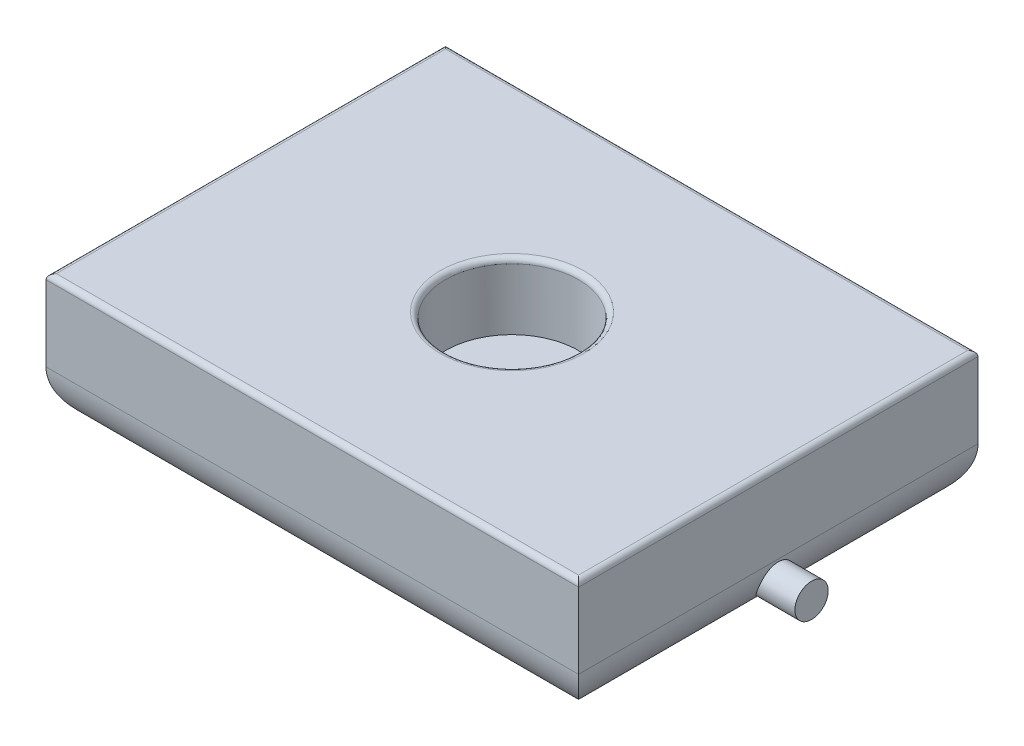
ISO-10303-21;
HEADER;
FILE_DESCRIPTION(('STEP AP214'),'2;1');
FILE_NAME('part.step','',(''),(''),'','','');
FILE_SCHEMA(('AUTOMOTIVE_DESIGN { 1 0 10303 214 1 1 1 1 }'));
ENDSEC;
DATA;
#1=APPLICATION_CONTEXT('core data for automotive mechanical design processes');
#2=APPLICATION_PROTOCOL_DEFINITION('international standard','automotive_design',2000,#1);
#3=PRODUCT_CONTEXT('',#1,'mechanical');
#4=PRODUCT('Part','Part','',(#3));
#5=PRODUCT_RELATED_PRODUCT_CATEGORY('part','',(#4));
#6=PRODUCT_DEFINITION_FORMATION('','',#4);
#7=PRODUCT_DEFINITION_CONTEXT('part definition',#1,'design');
#8=PRODUCT_DEFINITION('design','',#6,#7);
#9=PRODUCT_DEFINITION_SHAPE('','',#8);
#10=(LENGTH_UNIT() NAMED_UNIT(*) SI_UNIT(.MILLI.,.METRE.));
#11=(NAMED_UNIT(*) PLANE_ANGLE_UNIT() SI_UNIT($,.RADIAN.));
#12=(NAMED_UNIT(*) SI_UNIT($,.STERADIAN.) SOLID_ANGLE_UNIT());
#13=UNCERTAINTY_MEASURE_WITH_UNIT(LENGTH_MEASURE(1.E-05),#10,'distance_accuracy_value','');
#14=(GEOMETRIC_REPRESENTATION_CONTEXT(3) GLOBAL_UNCERTAINTY_ASSIGNED_CONTEXT((#13)) GLOBAL_UNIT_ASSIGNED_CONTEXT((#10,
#11,#12)) REPRESENTATION_CONTEXT('',''));
#15=CARTESIAN_POINT('',(0.,0.,0.));
#16=DIRECTION('',(0.,0.,1.));
#17=DIRECTION('',(1.,0.,0.));
#18=AXIS2_PLACEMENT_3D('',#15,#16,#17);
#19=CARTESIAN_POINT('',(-50.8,25.4,38.1));
#20=DIRECTION('',(1.,0.,0.));
#21=DIRECTION('',(0.,0.,-1.));
#22=AXIS2_PLACEMENT_3D('',#19,#20,#21);
#23=PLANE('',#22);
#24=DIRECTION('',(0.,-1.,0.));
#25=VECTOR('',#24,1.);
#26=CARTESIAN_POINT('',(-50.8,25.4,38.1));
#27=LINE('',#26,#25);
#28=CARTESIAN_POINT('',(-50.8,24.4,38.1));
#29=VERTEX_POINT('',#28);
#30=CARTESIAN_POINT('',(-50.8,10.,38.1));
#31=VERTEX_POINT('',#30);
#32=EDGE_CURVE('E115',#29,#31,#27,.T.);
#33=ORIENTED_EDGE('',*,*,#32,.F.);
#34=DIRECTION('',(0.,0.,1.));
#35=VECTOR('',#34,1.);
#36=CARTESIAN_POINT('',(-50.8,24.4,38.1));
#37=LINE('',#36,#35);
#38=CARTESIAN_POINT('',(-50.8,24.4,-38.1));
#39=VERTEX_POINT('',#38);
#40=EDGE_CURVE('E51',#29,#39,#37,.F.);
#41=ORIENTED_EDGE('',*,*,#40,.T.);
#42=DIRECTION('',(0.,-1.,0.));
#43=VECTOR('',#42,1.);
#44=CARTESIAN_POINT('',(-50.8,25.4,-38.1));
#45=LINE('',#44,#43);
#46=CARTESIAN_POINT('',(-50.8,10.,-38.1));
#47=VERTEX_POINT('',#46);
#48=EDGE_CURVE('E247',#39,#47,#45,.T.);
#49=ORIENTED_EDGE('',*,*,#48,.T.);
#50=DIRECTION('',(0.,0.,1.));
#51=VECTOR('',#50,1.);
#52=CARTESIAN_POINT('',(-50.8,10.,38.1));
#53=LINE('',#52,#51);
#54=EDGE_CURVE('E155',#47,#31,#53,.T.);
#55=ORIENTED_EDGE('',*,*,#54,.T.);
#56=EDGE_LOOP('',(#33,#41,#49,#55));
#57=FACE_BOUND('',#56,.T.);
#58=ADVANCED_FACE('F42',(#57),#23,.F.);
#59=CARTESIAN_POINT('',(-50.8,25.4,38.1));
#60=DIRECTION('',(0.,0.,-1.));
#61=DIRECTION('',(-1.,0.,0.));
#62=AXIS2_PLACEMENT_3D('',#59,#60,#61);
#63=PLANE('',#62);
#64=DIRECTION('',(0.,-1.,0.));
#65=VECTOR('',#64,1.);
#66=CARTESIAN_POINT('',(50.8,25.4,38.1));
#67=LINE('',#66,#65);
#68=CARTESIAN_POINT('',(50.8,24.4,38.1));
#69=VERTEX_POINT('',#68);
#70=CARTESIAN_POINT('',(50.8,10.,38.1));
#71=VERTEX_POINT('',#70);
#72=EDGE_CURVE('E108',#69,#71,#67,.T.);
#73=ORIENTED_EDGE('',*,*,#72,.F.);
#74=DIRECTION('',(1.,0.,0.));
#75=VECTOR('',#74,1.);
#76=CARTESIAN_POINT('',(-50.8,24.4,38.1));
#77=LINE('',#76,#75);
#78=EDGE_CURVE('E59',#69,#29,#77,.F.);
#79=ORIENTED_EDGE('',*,*,#78,.T.);
#80=ORIENTED_EDGE('',*,*,#32,.T.);
#81=DIRECTION('',(1.,0.,0.));
#82=VECTOR('',#81,1.);
#83=CARTESIAN_POINT('',(50.8,10.,38.1));
#84=LINE('',#83,#82);
#85=EDGE_CURVE('E124',#31,#71,#84,.T.);
#86=ORIENTED_EDGE('',*,*,#85,.T.);
#87=EDGE_LOOP('',(#73,#79,#80,#86));
#88=FACE_BOUND('',#87,.T.);
#89=ADVANCED_FACE('F138',(#88),#63,.F.);
#90=CARTESIAN_POINT('',(50.8,25.4,38.1));
#91=DIRECTION('',(-1.,0.,0.));
#92=DIRECTION('',(0.,0.,1.));
#93=AXIS2_PLACEMENT_3D('',#90,#91,#92);
#94=PLANE('',#93);
#95=DIRECTION('',(0.,-1.,0.));
#96=VECTOR('',#95,1.);
#97=CARTESIAN_POINT('',(50.8,25.4,-38.1));
#98=LINE('',#97,#96);
#99=CARTESIAN_POINT('',(50.8,24.4,-38.1));
#100=VERTEX_POINT('',#99);
#101=CARTESIAN_POINT('',(50.8,10.,-38.1));
#102=VERTEX_POINT('',#101);
#103=EDGE_CURVE('E116',#100,#102,#98,.T.);
#104=ORIENTED_EDGE('',*,*,#103,.F.);
#105=DIRECTION('',(0.,0.,-1.));
#106=VECTOR('',#105,1.);
#107=CARTESIAN_POINT('',(50.8,24.4,38.1));
#108=LINE('',#107,#106);
#109=EDGE_CURVE('E67',#100,#69,#108,.F.);
#110=ORIENTED_EDGE('',*,*,#109,.T.);
#111=ORIENTED_EDGE('',*,*,#72,.T.);
#112=DIRECTION('',(0.,0.,-1.));
#113=VECTOR('',#112,1.);
#114=CARTESIAN_POINT('',(50.8,10.,-38.1));
#115=LINE('',#114,#113);
#116=EDGE_CURVE('E112',#71,#102,#115,.T.);
#117=ORIENTED_EDGE('',*,*,#116,.T.);
#118=EDGE_LOOP('',(#104,#110,#111,#117));
#119=FACE_BOUND('',#118,.T.);
#120=ADVANCED_FACE('F110',(#119),#94,.F.);
#121=CARTESIAN_POINT('',(-50.8,25.4,-38.1));
#122=DIRECTION('',(0.,0.,1.));
#123=DIRECTION('',(1.,0.,0.));
#124=AXIS2_PLACEMENT_3D('',#121,#122,#123);
#125=PLANE('',#124);
#126=ORIENTED_EDGE('',*,*,#48,.F.);
#127=DIRECTION('',(-1.,0.,0.));
#128=VECTOR('',#127,1.);
#129=CARTESIAN_POINT('',(-50.8,24.4,-38.1));
#130=LINE('',#129,#128);
#131=EDGE_CURVE('E260',#39,#100,#130,.F.);
#132=ORIENTED_EDGE('',*,*,#131,.T.);
#133=ORIENTED_EDGE('',*,*,#103,.T.);
#134=DIRECTION('',(-1.,0.,0.));
#135=VECTOR('',#134,1.);
#136=CARTESIAN_POINT('',(-50.8,10.,-38.1));
#137=LINE('',#136,#135);
#138=EDGE_CURVE('E136',#102,#47,#137,.T.);
#139=ORIENTED_EDGE('',*,*,#138,.T.);
#140=EDGE_LOOP('',(#126,#132,#133,#139));
#141=FACE_BOUND('',#140,.T.);
#142=ADVANCED_FACE('F220',(#141),#125,.F.);
#143=CARTESIAN_POINT('',(0.,25.4,0.));
#144=DIRECTION('',(0.,-1.,0.));
#145=DIRECTION('',(0.,0.,-1.));
#146=AXIS2_PLACEMENT_3D('',#143,#144,#145);
#147=PLANE('',#146);
#148=DIRECTION('',(0.,0.,-1.));
#149=VECTOR('',#148,1.);
#150=CARTESIAN_POINT('',(49.8,25.4,0.));
#151=LINE('',#150,#149);
#152=CARTESIAN_POINT('',(49.8,25.4,37.1));
#153=VERTEX_POINT('',#152);
#154=CARTESIAN_POINT('',(49.8,25.4,-37.1));
#155=VERTEX_POINT('',#154);
#156=EDGE_CURVE('E266',#153,#155,#151,.T.);
#157=ORIENTED_EDGE('',*,*,#156,.T.);
#158=DIRECTION('',(-1.,0.,0.));
#159=VECTOR('',#158,1.);
#160=CARTESIAN_POINT('',(0.,25.4,-37.1));
#161=LINE('',#160,#159);
#162=CARTESIAN_POINT('',(-49.8,25.4,-37.1));
#163=VERTEX_POINT('',#162);
#164=EDGE_CURVE('E262',#155,#163,#161,.T.);
#165=ORIENTED_EDGE('',*,*,#164,.T.);
#166=DIRECTION('',(0.,0.,1.));
#167=VECTOR('',#166,1.);
#168=CARTESIAN_POINT('',(-49.8,25.4,0.));
#169=LINE('',#168,#167);
#170=CARTESIAN_POINT('',(-49.8,25.4,37.1));
#171=VERTEX_POINT('',#170);
#172=EDGE_CURVE('E518',#163,#171,#169,.T.);
#173=ORIENTED_EDGE('',*,*,#172,.T.);
#174=DIRECTION('',(1.,0.,0.));
#175=VECTOR('',#174,1.);
#176=CARTESIAN_POINT('',(0.,25.4,37.1));
#177=LINE('',#176,#175);
#178=EDGE_CURVE('E284',#171,#153,#177,.T.);
#179=ORIENTED_EDGE('',*,*,#178,.T.);
#180=EDGE_LOOP('',(#157,#165,#173,#179));
#181=FACE_BOUND('',#180,.T.);
#182=CARTESIAN_POINT('',(0.,25.4,0.));
#183=DIRECTION('',(0.,-1.,0.));
#184=DIRECTION('',(0.,0.,-1.));
#185=AXIS2_PLACEMENT_3D('',#182,#183,#184);
#186=CIRCLE('',#185,13.7);
#187=CARTESIAN_POINT('',(0.,25.4,-13.7));
#188=VERTEX_POINT('',#187);
#189=EDGE_CURVE('E156',#188,#188,#186,.T.);
#190=ORIENTED_EDGE('',*,*,#189,.T.);
#191=EDGE_LOOP('',(#190));
#192=FACE_BOUND('',#191,.T.);
#193=ADVANCED_FACE('F223',(#181,#192),#147,.F.);
#194=CARTESIAN_POINT('',(0.,0.,0.));
#195=DIRECTION('',(0.,-1.,0.));
#196=DIRECTION('',(0.,0.,-1.));
#197=AXIS2_PLACEMENT_3D('',#194,#195,#196);
#198=PLANE('',#197);
#199=DIRECTION('',(0.,0.,-1.));
#200=VECTOR('',#199,1.);
#201=CARTESIAN_POINT('',(40.8,0.,38.1));
#202=LINE('',#201,#200);
#203=CARTESIAN_POINT('',(40.8,0.,-28.1));
#204=VERTEX_POINT('',#203);
#205=CARTESIAN_POINT('',(40.8,0.,28.1));
#206=VERTEX_POINT('',#205);
#207=EDGE_CURVE('E150',#204,#206,#202,.F.);
#208=ORIENTED_EDGE('',*,*,#207,.T.);
#209=DIRECTION('',(1.,0.,0.));
#210=VECTOR('',#209,1.);
#211=CARTESIAN_POINT('',(-50.8,0.,28.1));
#212=LINE('',#211,#210);
#213=CARTESIAN_POINT('',(-40.8,0.,28.1));
#214=VERTEX_POINT('',#213);
#215=EDGE_CURVE('E126',#206,#214,#212,.F.);
#216=ORIENTED_EDGE('',*,*,#215,.T.);
#217=DIRECTION('',(0.,0.,1.));
#218=VECTOR('',#217,1.);
#219=CARTESIAN_POINT('',(-40.8,0.,-38.1));
#220=LINE('',#219,#218);
#221=CARTESIAN_POINT('',(-40.8,0.,-28.1));
#222=VERTEX_POINT('',#221);
#223=EDGE_CURVE('E140',#214,#222,#220,.F.);
#224=ORIENTED_EDGE('',*,*,#223,.T.);
#225=DIRECTION('',(-1.,0.,0.));
#226=VECTOR('',#225,1.);
#227=CARTESIAN_POINT('',(50.8,0.,-28.1));
#228=LINE('',#227,#226);
#229=EDGE_CURVE('E143',#222,#204,#228,.F.);
#230=ORIENTED_EDGE('',*,*,#229,.T.);
#231=EDGE_LOOP('',(#208,#216,#224,#230));
#232=FACE_BOUND('',#231,.T.);
#233=ADVANCED_FACE('F225',(#232),#198,.T.);
#234=CARTESIAN_POINT('',(0.,12.7,0.));
#235=DIRECTION('',(0.,1.,0.));
#236=DIRECTION('',(0.,0.,1.));
#237=AXIS2_PLACEMENT_3D('',#234,#235,#236);
#238=CYLINDRICAL_SURFACE('',#237,12.7);
#239=CARTESIAN_POINT('',(0.,24.4,0.));
#240=DIRECTION('',(0.,-1.,0.));
#241=DIRECTION('',(0.,0.,-1.));
#242=AXIS2_PLACEMENT_3D('',#239,#240,#241);
#243=CIRCLE('',#242,12.7);
#244=CARTESIAN_POINT('',(0.,24.4,-12.7));
#245=VERTEX_POINT('',#244);
#246=EDGE_CURVE('E11',#245,#245,#243,.F.);
#247=ORIENTED_EDGE('',*,*,#246,.T.);
#248=EDGE_LOOP('',(#247));
#249=FACE_BOUND('',#248,.T.);
#250=CARTESIAN_POINT('',(0.,12.7,0.));
#251=DIRECTION('',(0.,1.,0.));
#252=DIRECTION('',(0.,0.,1.));
#253=AXIS2_PLACEMENT_3D('',#250,#251,#252);
#254=CIRCLE('',#253,12.7);
#255=CARTESIAN_POINT('',(0.,12.7,12.7));
#256=VERTEX_POINT('',#255);
#257=EDGE_CURVE('E245',#256,#256,#254,.T.);
#258=ORIENTED_EDGE('',*,*,#257,.F.);
#259=EDGE_LOOP('',(#258));
#260=FACE_BOUND('',#259,.T.);
#261=ADVANCED_FACE('F228',(#249,#260),#238,.F.);
#262=CARTESIAN_POINT('',(0.,12.7,0.));
#263=DIRECTION('',(0.,1.,0.));
#264=DIRECTION('',(0.,0.,1.));
#265=AXIS2_PLACEMENT_3D('',#262,#263,#264);
#266=PLANE('',#265);
#267=ORIENTED_EDGE('',*,*,#257,.T.);
#268=EDGE_LOOP('',(#267));
#269=FACE_BOUND('',#268,.T.);
#270=ADVANCED_FACE('F234',(#269),#266,.T.);
#271=CARTESIAN_POINT('',(57.15,6.35,0.));
#272=DIRECTION('',(-1.,0.,0.));
#273=DIRECTION('',(0.,0.,1.));
#274=AXIS2_PLACEMENT_3D('',#271,#272,#273);
#275=CYLINDRICAL_SURFACE('',#274,3.175);
#276=CARTESIAN_POINT('',(57.15,6.35,0.));
#277=DIRECTION('',(1.,0.,0.));
#278=DIRECTION('',(0.,0.,-1.));
#279=AXIS2_PLACEMENT_3D('',#276,#277,#278);
#280=CIRCLE('',#279,3.175);
#281=CARTESIAN_POINT('',(57.15,6.35,-3.175));
#282=VERTEX_POINT('',#281);
#283=EDGE_CURVE('E248',#282,#282,#280,.T.);
#284=ORIENTED_EDGE('',*,*,#283,.F.);
#285=EDGE_LOOP('',(#284));
#286=FACE_BOUND('',#285,.T.);
#287=CARTESIAN_POINT('',(50.1936511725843,6.57081385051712,-3.16731214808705));
#288=CARTESIAN_POINT('',(50.2547884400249,6.7383089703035,-3.1556257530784));
#289=CARTESIAN_POINT('',(50.3111683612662,6.90677063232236,-3.1304917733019));
#290=CARTESIAN_POINT('',(50.4133314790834,7.24057988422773,-3.05236165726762));
#291=CARTESIAN_POINT('',(50.4591056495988,7.40592471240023,-2.99934191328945));
#292=CARTESIAN_POINT('',(50.5399370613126,7.72815893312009,-2.86561646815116));
#293=CARTESIAN_POINT('',(50.5749785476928,7.88503561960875,-2.78487043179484));
#294=CARTESIAN_POINT('',(50.6350055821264,8.18450353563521,-2.59738800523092));
#295=CARTESIAN_POINT('',(50.6599929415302,8.32709733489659,-2.49065630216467));
#296=CARTESIAN_POINT('',(50.7008684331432,8.58933830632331,-2.25741640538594));
#297=CARTESIAN_POINT('',(50.7169909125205,8.70951455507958,-2.13154282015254));
#298=CARTESIAN_POINT('',(50.742977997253,8.92793704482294,-1.86146002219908));
#299=CARTESIAN_POINT('',(50.7528422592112,9.02618208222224,-1.71724980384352));
#300=CARTESIAN_POINT('',(50.7681985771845,9.19839324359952,-1.41349593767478));
#301=CARTESIAN_POINT('',(50.7736605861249,9.27219052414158,-1.25385510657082));
#302=CARTESIAN_POINT('',(50.7817112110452,9.39246814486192,-0.924526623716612));
#303=CARTESIAN_POINT('',(50.7842996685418,9.43894697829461,-0.75483841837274));
#304=CARTESIAN_POINT('',(50.7877310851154,9.50370340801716,-0.407840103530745));
#305=CARTESIAN_POINT('',(50.7885507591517,9.521604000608,-0.230459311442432));
#306=CARTESIAN_POINT('',(50.7888321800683,9.52751696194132,0.124804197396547));
#307=CARTESIAN_POINT('',(50.78829387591,9.51552820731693,0.302686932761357));
#308=CARTESIAN_POINT('',(50.7855478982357,9.461904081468,0.654571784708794));
#309=CARTESIAN_POINT('',(50.7833342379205,9.42016242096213,0.828557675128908));
#310=CARTESIAN_POINT('',(50.7761929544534,9.30811658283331,1.16702551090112));
#311=CARTESIAN_POINT('',(50.7712652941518,9.23781201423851,1.33150732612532));
#312=CARTESIAN_POINT('',(50.7570960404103,9.07091192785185,1.64585995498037));
#313=CARTESIAN_POINT('',(50.747864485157,8.97437780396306,1.79576379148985));
#314=CARTESIAN_POINT('',(50.723158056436,8.75792221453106,2.07702028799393));
#315=CARTESIAN_POINT('',(50.7076839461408,8.63800360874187,2.2083752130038));
#316=CARTESIAN_POINT('',(50.6687939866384,8.38023114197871,2.44730444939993));
#317=CARTESIAN_POINT('',(50.6454751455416,8.2426084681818,2.55514391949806));
#318=CARTESIAN_POINT('',(50.5893474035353,7.95295418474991,2.74613344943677));
#319=CARTESIAN_POINT('',(50.5565399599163,7.800924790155,2.82928729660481));
#320=CARTESIAN_POINT('',(50.480981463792,7.48921703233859,2.9684422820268));
#321=CARTESIAN_POINT('',(50.4383360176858,7.32963328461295,3.02471356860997));
#322=CARTESIAN_POINT('',(50.3429099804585,7.00646329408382,3.11089463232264));
#323=CARTESIAN_POINT('',(50.2901280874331,6.84287653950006,3.14080102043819));
#324=CARTESIAN_POINT('',(50.1733815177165,6.5112198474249,3.17542295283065));
#325=CARTESIAN_POINT('',(50.1091166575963,6.34317123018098,3.17931428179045));
#326=CARTESIAN_POINT('',(49.9721415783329,6.01202046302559,3.1613171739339));
#327=CARTESIAN_POINT('',(49.8994288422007,5.84891980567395,3.13942103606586));
#328=CARTESIAN_POINT('',(49.7403317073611,5.5158434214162,3.06862863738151));
#329=CARTESIAN_POINT('',(49.6533046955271,5.34667907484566,3.01737207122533));
#330=CARTESIAN_POINT('',(49.4744415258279,5.02118136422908,2.88886405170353));
#331=CARTESIAN_POINT('',(49.3826013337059,4.8648590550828,2.81159048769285));
#332=CARTESIAN_POINT('',(49.1863658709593,4.54955703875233,2.62236554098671));
#333=CARTESIAN_POINT('',(49.0817883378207,4.39251626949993,2.5073624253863));
#334=CARTESIAN_POINT('',(48.8764197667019,4.10057156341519,2.24914785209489));
#335=CARTESIAN_POINT('',(48.7756281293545,3.96566411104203,2.10594088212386));
#336=CARTESIAN_POINT('',(48.6043654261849,3.7464253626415,1.82405235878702));
#337=CARTESIAN_POINT('',(48.5318755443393,3.65737993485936,1.69026524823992));
#338=CARTESIAN_POINT('',(48.3989740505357,3.49874795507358,1.40618147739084));
#339=CARTESIAN_POINT('',(48.3385418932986,3.42912822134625,1.25591358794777));
#340=CARTESIAN_POINT('',(48.2458917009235,3.3244772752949,0.97208985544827));
#341=CARTESIAN_POINT('',(48.2104562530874,3.28532658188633,0.841118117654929));
#342=CARTESIAN_POINT('',(48.1543834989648,3.2239541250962,0.572209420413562));
#343=CARTESIAN_POINT('',(48.1337319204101,3.20171603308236,0.43427931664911));
#344=CARTESIAN_POINT('',(48.1094751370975,3.17563784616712,0.154487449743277));
#345=CARTESIAN_POINT('',(48.1059507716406,3.17188499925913,0.0126102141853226));
#346=CARTESIAN_POINT('',(48.1166212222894,3.18332155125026,-0.269701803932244));
#347=CARTESIAN_POINT('',(48.1308187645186,3.19851386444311,-0.41013636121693));
#348=CARTESIAN_POINT('',(48.1736877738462,3.24503016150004,-0.67583928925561));
#349=CARTESIAN_POINT('',(48.2013119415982,3.27518980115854,-0.801490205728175));
#350=CARTESIAN_POINT('',(48.268008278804,3.34933577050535,-1.04542898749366));
#351=CARTESIAN_POINT('',(48.3070882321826,3.39333150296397,-1.16371177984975));
#352=CARTESIAN_POINT('',(48.4130662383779,3.51538393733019,-1.44137599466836));
#353=CARTESIAN_POINT('',(48.4846569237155,3.5999228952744,-1.59612114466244));
#354=CARTESIAN_POINT('',(48.6389963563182,3.78991497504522,-1.88592975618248));
#355=CARTESIAN_POINT('',(48.721762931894,3.89540164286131,-2.02096103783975));
#356=CARTESIAN_POINT('',(48.8945456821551,4.12637376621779,-2.27283946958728));
#357=CARTESIAN_POINT('',(48.9846657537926,4.25218585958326,-2.38931436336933));
#358=CARTESIAN_POINT('',(49.1664222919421,4.52010357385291,-2.60023368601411));
#359=CARTESIAN_POINT('',(49.2580593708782,4.66221591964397,-2.69466897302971));
#360=CARTESIAN_POINT('',(49.4553561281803,4.98733005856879,-2.87472167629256));
#361=CARTESIAN_POINT('',(49.5606351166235,5.17312122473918,-2.95583861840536));
#362=CARTESIAN_POINT('',(49.7123970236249,5.46335025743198,-3.05038261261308));
#363=CARTESIAN_POINT('',(49.7619387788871,5.56197328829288,-3.07736974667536));
#364=CARTESIAN_POINT('',(49.8584843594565,5.76252384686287,-3.12186342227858));
#365=CARTESIAN_POINT('',(49.9054895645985,5.86444952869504,-3.13937516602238));
#366=CARTESIAN_POINT('',(49.9944700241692,6.06638057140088,-3.16386989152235));
#367=CARTESIAN_POINT('',(50.0365750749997,6.16627704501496,-3.17127715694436));
#368=CARTESIAN_POINT('',(50.1175895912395,6.36760123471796,-3.1765495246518));
#369=CARTESIAN_POINT('',(50.1564987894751,6.46902907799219,-3.17441382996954));
#370=CARTESIAN_POINT('',(50.1936511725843,6.57081385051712,-3.16731214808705));
#371=B_SPLINE_CURVE_WITH_KNOTS('',3,(#287,#288,#289,#290,#291,#292,#293,#294,#295,#296,#297,
#298,#299,#300,#301,#302,#303,#304,#305,#306,#307,#308,#309,#310,#311,#312,#313,#314,#315,#316,
#317,#318,#319,#320,#321,#322,#323,#324,#325,#326,#327,#328,#329,#330,#331,#332,#333,#334,#335,
#336,#337,#338,#339,#340,#341,#342,#343,#344,#345,#346,#347,#348,#349,#350,#351,#352,#353,#354,
#355,#356,#357,#358,#359,#360,#361,#362,#363,#364,#365,#366,#367,#368,#369,#370),.UNSPECIFIED.,
.T.,.F.,(4,2,2,2,2,2,2,2,2,2,2,2,2,2,2,2,2,2,2,2,2,2,2,2,2,2,2,2,2,2,2,2,2,2,2,2,2,2,2,2,2,4),
(0.,0.535698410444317,1.07185106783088,1.60878702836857,2.14562621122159,2.66749251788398,
3.18938745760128,3.71481506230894,4.24027164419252,4.77260440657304,5.30495717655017,
5.83922131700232,6.37349277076,6.90652430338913,7.43949069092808,7.96609488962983,
8.49261825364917,9.01373297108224,9.53491466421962,10.0725333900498,10.6103127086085,
11.1990140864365,11.7882170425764,12.4482389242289,13.1081558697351,13.6352014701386,
14.1613412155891,14.5832808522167,15.0048125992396,15.4283320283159,15.8519166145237,
16.2467639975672,16.6418802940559,17.2097133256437,17.7784631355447,18.3574798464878,
18.9367363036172,19.618262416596,19.9587405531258,20.2990315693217,20.6245418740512,
20.9500793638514),.UNSPECIFIED.);
#372=CARTESIAN_POINT('',(50.1936511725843,6.57081385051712,-3.16731214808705));
#373=VERTEX_POINT('',#372);
#374=EDGE_CURVE('E141',#373,#373,#371,.T.);
#375=ORIENTED_EDGE('',*,*,#374,.T.);
#376=EDGE_LOOP('',(#375));
#377=FACE_BOUND('',#376,.T.);
#378=ADVANCED_FACE('F175',(#286,#377),#275,.T.);
#379=CARTESIAN_POINT('',(57.15,0.,0.));
#380=DIRECTION('',(1.,0.,0.));
#381=DIRECTION('',(0.,0.,-1.));
#382=AXIS2_PLACEMENT_3D('',#379,#380,#381);
#383=PLANE('',#382);
#384=ORIENTED_EDGE('',*,*,#283,.T.);
#385=EDGE_LOOP('',(#384));
#386=FACE_BOUND('',#385,.T.);
#387=ADVANCED_FACE('F241',(#386),#383,.T.);
#388=CARTESIAN_POINT('',(-57.15,6.35,0.));
#389=DIRECTION('',(1.,0.,0.));
#390=DIRECTION('',(0.,0.,-1.));
#391=AXIS2_PLACEMENT_3D('',#388,#389,#390);
#392=CYLINDRICAL_SURFACE('',#391,3.175);
#393=CARTESIAN_POINT('',(-57.15,6.35,0.));
#394=DIRECTION('',(1.,0.,0.));
#395=DIRECTION('',(0.,0.,-1.));
#396=AXIS2_PLACEMENT_3D('',#393,#394,#395);
#397=CIRCLE('',#396,3.175);
#398=CARTESIAN_POINT('',(-57.15,6.35,-3.175));
#399=VERTEX_POINT('',#398);
#400=EDGE_CURVE('E252',#399,#399,#397,.T.);
#401=ORIENTED_EDGE('',*,*,#400,.T.);
#402=EDGE_LOOP('',(#401));
#403=FACE_BOUND('',#402,.T.);
#404=CARTESIAN_POINT('',(-50.1936511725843,6.57081385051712,3.16731214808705));
#405=CARTESIAN_POINT('',(-50.1585510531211,6.47466489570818,3.17401475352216));
#406=CARTESIAN_POINT('',(-50.1218566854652,6.37874684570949,3.17629596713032));
#407=CARTESIAN_POINT('',(-50.0455880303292,6.18821899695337,3.17231033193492));
#408=CARTESIAN_POINT('',(-50.006011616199,6.0936102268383,3.16603710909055));
#409=CARTESIAN_POINT('',(-49.8832495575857,5.81236399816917,3.13482876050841));
#410=CARTESIAN_POINT('',(-49.7961609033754,5.62866137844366,3.09748279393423));
#411=CARTESIAN_POINT('',(-49.6155323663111,5.27498866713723,2.99313515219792));
#412=CARTESIAN_POINT('',(-49.5220334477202,5.1049441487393,2.92630922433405));
#413=CARTESIAN_POINT('',(-49.3316439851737,4.78018486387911,2.76570283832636));
#414=CARTESIAN_POINT('',(-49.2347529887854,4.62547215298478,2.6719187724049));
#415=CARTESIAN_POINT('',(-49.032057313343,4.31931492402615,2.44874590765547));
#416=CARTESIAN_POINT('',(-48.9263228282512,4.16972025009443,2.3167464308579));
#417=CARTESIAN_POINT('',(-48.7224006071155,3.89552058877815,2.02393411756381));
#418=CARTESIAN_POINT('',(-48.6242063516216,3.77089386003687,1.86314658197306));
#419=CARTESIAN_POINT('',(-48.4699128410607,3.58261232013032,1.56335164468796));
#420=CARTESIAN_POINT('',(-48.4097540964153,3.51167599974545,1.43100166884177));
#421=CARTESIAN_POINT('',(-48.3024966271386,3.38794698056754,1.15320550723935));
#422=CARTESIAN_POINT('',(-48.2553746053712,3.33512187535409,1.00778330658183));
#423=CARTESIAN_POINT('',(-48.1849692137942,3.2572584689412,0.730056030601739));
#424=CARTESIAN_POINT('',(-48.159105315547,3.22916050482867,0.599273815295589));
#425=CARTESIAN_POINT('',(-48.122576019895,3.18966748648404,0.333130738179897));
#426=CARTESIAN_POINT('',(-48.1119001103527,3.1782608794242,0.197773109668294));
#427=CARTESIAN_POINT('',(-48.1069408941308,3.17294841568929,-0.0738511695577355));
#428=CARTESIAN_POINT('',(-48.1126885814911,3.1790756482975,-0.210119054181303));
#429=CARTESIAN_POINT('',(-48.1399717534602,3.20844680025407,-0.4791756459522));
#430=CARTESIAN_POINT('',(-48.1615144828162,3.23169857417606,-0.611962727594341));
#431=CARTESIAN_POINT('',(-48.217691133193,3.29332154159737,-0.868620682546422));
#432=CARTESIAN_POINT('',(-48.2521089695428,3.33144359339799,-0.992600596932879));
#433=CARTESIAN_POINT('',(-48.3313089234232,3.42102123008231,-1.23210733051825));
#434=CARTESIAN_POINT('',(-48.3760982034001,3.47248603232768,-1.34762823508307));
#435=CARTESIAN_POINT('',(-48.4973441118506,3.61537696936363,-1.62393841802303));
#436=CARTESIAN_POINT('',(-48.5785241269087,3.71399330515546,-1.77895334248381));
#437=CARTESIAN_POINT('',(-48.7505065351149,3.93296680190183,-2.06673100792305));
#438=CARTESIAN_POINT('',(-48.8413252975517,4.05336120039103,-2.1994548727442));
#439=CARTESIAN_POINT('',(-49.0283758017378,4.31492210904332,-2.44368393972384));
#440=CARTESIAN_POINT('',(-49.1246706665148,4.45638856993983,-2.55481804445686));
#441=CARTESIAN_POINT('',(-49.3167584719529,4.75629180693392,-2.75188543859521));
#442=CARTESIAN_POINT('',(-49.4125514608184,4.91472692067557,-2.83782119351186));
#443=CARTESIAN_POINT('',(-49.5586934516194,5.17332651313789,-2.95065717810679));
#444=CARTESIAN_POINT('',(-49.6105786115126,5.26863754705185,-2.9869325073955));
#445=CARTESIAN_POINT('',(-49.7123509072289,5.46325750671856,-3.05037342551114));
#446=CARTESIAN_POINT('',(-49.7622388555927,5.56256477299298,-3.07754275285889));
#447=CARTESIAN_POINT('',(-49.8594612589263,5.76458535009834,-3.12227847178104));
#448=CARTESIAN_POINT('',(-49.9067948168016,5.86729983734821,-3.13984150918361));
#449=CARTESIAN_POINT('',(-49.9983344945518,6.07526627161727,-3.16482294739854));
#450=CARTESIAN_POINT('',(-50.0425425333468,6.1805166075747,-3.17224762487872));
#451=CARTESIAN_POINT('',(-50.1240864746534,6.38440669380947,-3.17632089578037));
#452=CARTESIAN_POINT('',(-50.1616894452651,6.48292381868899,-3.17376279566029));
#453=CARTESIAN_POINT('',(-50.2335362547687,6.68044756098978,-3.15930810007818));
#454=CARTESIAN_POINT('',(-50.2677819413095,6.7794538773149,-3.14741667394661));
#455=CARTESIAN_POINT('',(-50.3326877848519,6.97697741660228,-3.11408896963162));
#456=CARTESIAN_POINT('',(-50.3633499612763,7.07549488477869,-3.0926581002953));
#457=CARTESIAN_POINT('',(-50.4209727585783,7.27103168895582,-3.04015937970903));
#458=CARTESIAN_POINT('',(-50.4479338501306,7.36805121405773,-3.00909275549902));
#459=CARTESIAN_POINT('',(-50.4950430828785,7.54771934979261,-2.94179100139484));
#460=CARTESIAN_POINT('',(-50.5156212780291,7.63067003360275,-2.90665855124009));
#461=CARTESIAN_POINT('',(-50.5539659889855,7.79383309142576,-2.8291572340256));
#462=CARTESIAN_POINT('',(-50.5717315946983,7.87404457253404,-2.78678603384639));
#463=CARTESIAN_POINT('',(-50.6045435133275,8.03090317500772,-2.69507587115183));
#464=CARTESIAN_POINT('',(-50.6195914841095,8.10755244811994,-2.64574118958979));
#465=CARTESIAN_POINT('',(-50.647153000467,8.25663108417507,-2.54041914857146));
#466=CARTESIAN_POINT('',(-50.6596656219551,8.32905890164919,-2.48442937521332));
#467=CARTESIAN_POINT('',(-50.6924455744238,8.53119155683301,-2.31362881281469));
#468=CARTESIAN_POINT('',(-50.709740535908,8.65468631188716,-2.19071234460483));
#469=CARTESIAN_POINT('',(-50.7377491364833,8.88012531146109,-1.92597279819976));
#470=CARTESIAN_POINT('',(-50.7484628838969,8.98206991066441,-1.78415003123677));
#471=CARTESIAN_POINT('',(-50.7652228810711,9.16182676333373,-1.4848696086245));
#472=CARTESIAN_POINT('',(-50.7712491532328,9.2395348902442,-1.32734822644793));
#473=CARTESIAN_POINT('',(-50.7802155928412,9.36796573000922,-1.00158638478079));
#474=CARTESIAN_POINT('',(-50.7831555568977,9.41868666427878,-0.833345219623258));
#475=CARTESIAN_POINT('',(-50.7871694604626,9.49222223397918,-0.488440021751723));
#476=CARTESIAN_POINT('',(-50.7882174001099,9.51464678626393,-0.311692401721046));
#477=CARTESIAN_POINT('',(-50.7889362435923,9.52966898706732,0.043071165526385));
#478=CARTESIAN_POINT('',(-50.7886070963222,9.52226552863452,0.221087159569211));
#479=CARTESIAN_POINT('',(-50.7863778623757,9.47774654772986,0.574116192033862));
#480=CARTESIAN_POINT('',(-50.7844712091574,9.44050684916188,0.749113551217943));
#481=CARTESIAN_POINT('',(-50.7781455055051,9.3372272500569,1.09035599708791));
#482=CARTESIAN_POINT('',(-50.7737263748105,9.27118642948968,1.25660080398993));
#483=CARTESIAN_POINT('',(-50.7608458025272,9.11238781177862,1.57526853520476));
#484=CARTESIAN_POINT('',(-50.752391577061,9.01967782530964,1.72771555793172));
#485=CARTESIAN_POINT('',(-50.7295393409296,8.81033990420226,2.0146657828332));
#486=CARTESIAN_POINT('',(-50.7151425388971,8.69371683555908,2.14917262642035));
#487=CARTESIAN_POINT('',(-50.6786565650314,8.44175527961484,2.39495447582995));
#488=CARTESIAN_POINT('',(-50.6566565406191,8.30664419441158,2.50647579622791));
#489=CARTESIAN_POINT('',(-50.6033265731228,8.02115429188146,2.70520129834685));
#490=CARTESIAN_POINT('',(-50.571993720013,7.87077072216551,2.79239787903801));
#491=CARTESIAN_POINT('',(-50.4994490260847,7.56163469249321,2.93965790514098));
#492=CARTESIAN_POINT('',(-50.4583481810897,7.40299087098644,3.00000576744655));
#493=CARTESIAN_POINT('',(-50.3659898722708,7.08113868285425,3.09420312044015));
#494=CARTESIAN_POINT('',(-50.3147522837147,6.91793977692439,3.12810383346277));
#495=CARTESIAN_POINT('',(-50.2483098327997,6.72425419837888,3.15301829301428));
#496=CARTESIAN_POINT('',(-50.2376062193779,6.69354385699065,3.15651004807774));
#497=CARTESIAN_POINT('',(-50.2158727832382,6.63215247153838,3.16258831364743));
#498=CARTESIAN_POINT('',(-50.2048430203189,6.60147142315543,3.16517498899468));
#499=CARTESIAN_POINT('',(-50.1936511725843,6.57081385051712,3.16731214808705));
#500=B_SPLINE_CURVE_WITH_KNOTS('',3,(#404,#405,#406,#407,#408,#409,#410,#411,#412,#413,#414,
#415,#416,#417,#418,#419,#420,#421,#422,#423,#424,#425,#426,#427,#428,#429,#430,#431,#432,#433,
#434,#435,#436,#437,#438,#439,#440,#441,#442,#443,#444,#445,#446,#447,#448,#449,#450,#451,#452,
#453,#454,#455,#456,#457,#458,#459,#460,#461,#462,#463,#464,#465,#466,#467,#468,#469,#470,#471,
#472,#473,#474,#475,#476,#477,#478,#479,#480,#481,#482,#483,#484,#485,#486,#487,#488,#489,#490,
#491,#492,#493,#494,#495,#496,#497,#498,#499),.UNSPECIFIED.,.T.,.F.,(4,2,2,2,2,2,2,2,2,2,2,2,2,
2,2,2,2,2,2,2,2,2,2,2,2,2,2,2,2,2,2,2,2,2,2,2,2,2,2,2,2,2,2,2,2,2,2,4),(0.,0.307682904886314,
0.615595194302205,1.23253974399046,1.84585500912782,2.45925239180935,3.13355597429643,
3.8072698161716,4.29086973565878,4.77359977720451,5.1805747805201,5.58726796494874,
5.9947291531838,6.40237734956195,6.80347032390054,7.20484112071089,7.8041720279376,
8.40453756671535,9.01445285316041,9.62430844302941,9.96719006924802,10.3099307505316,
10.6527910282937,10.9954389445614,11.3114335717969,11.6272533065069,11.942894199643,
12.2584949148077,12.5353520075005,12.8122985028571,13.0890754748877,13.3659531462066,
13.8885411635,14.4111205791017,14.9359151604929,15.460744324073,15.9927322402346,
16.5247398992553,17.0589733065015,17.5932237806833,18.1265223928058,18.6597125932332,
19.1868521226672,19.7141561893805,20.2357330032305,20.7562971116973,20.8544212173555,
20.9525274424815),.UNSPECIFIED.);
#501=CARTESIAN_POINT('',(-50.1936511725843,6.57081385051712,3.16731214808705));
#502=VERTEX_POINT('',#501);
#503=EDGE_CURVE('E162',#502,#502,#500,.T.);
#504=ORIENTED_EDGE('',*,*,#503,.F.);
#505=EDGE_LOOP('',(#504));
#506=FACE_BOUND('',#505,.T.);
#507=ADVANCED_FACE('F296',(#403,#506),#392,.T.);
#508=CARTESIAN_POINT('',(-57.15,0.,0.));
#509=DIRECTION('',(-1.,0.,0.));
#510=DIRECTION('',(0.,0.,-1.));
#511=AXIS2_PLACEMENT_3D('',#508,#509,#510);
#512=PLANE('',#511);
#513=ORIENTED_EDGE('',*,*,#400,.F.);
#514=EDGE_LOOP('',(#513));
#515=FACE_BOUND('',#514,.T.);
#516=ADVANCED_FACE('F191',(#515),#512,.T.);
#517=CARTESIAN_POINT('',(-50.8,10.,-28.1));
#518=DIRECTION('',(1.,0.,0.));
#519=DIRECTION('',(0.,0.,-1.));
#520=AXIS2_PLACEMENT_3D('',#517,#518,#519);
#521=CYLINDRICAL_SURFACE('',#520,10.);
#522=CARTESIAN_POINT('',(40.8,10.,-28.1));
#523=DIRECTION('',(0.707106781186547,0.,0.707106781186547));
#524=DIRECTION('',(0.707106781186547,0.,-0.707106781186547));
#525=AXIS2_PLACEMENT_3D('',#522,#523,#524);
#526=ELLIPSE('',#525,14.1421356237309,10.);
#527=EDGE_CURVE('E135',#204,#102,#526,.T.);
#528=ORIENTED_EDGE('',*,*,#527,.F.);
#529=ORIENTED_EDGE('',*,*,#229,.F.);
#530=CARTESIAN_POINT('',(-40.8,10.,-28.1));
#531=DIRECTION('',(0.707106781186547,0.,-0.707106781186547));
#532=DIRECTION('',(-0.707106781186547,0.,-0.707106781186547));
#533=AXIS2_PLACEMENT_3D('',#530,#531,#532);
#534=ELLIPSE('',#533,14.1421356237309,10.);
#535=EDGE_CURVE('E160',#47,#222,#534,.F.);
#536=ORIENTED_EDGE('',*,*,#535,.F.);
#537=ORIENTED_EDGE('',*,*,#138,.F.);
#538=EDGE_LOOP('',(#528,#529,#536,#537));
#539=FACE_BOUND('',#538,.T.);
#540=ADVANCED_FACE('F187',(#539),#521,.T.);
#541=CARTESIAN_POINT('',(-40.8,10.,38.1));
#542=DIRECTION('',(0.,0.,-1.));
#543=DIRECTION('',(-1.,0.,0.));
#544=AXIS2_PLACEMENT_3D('',#541,#542,#543);
#545=CYLINDRICAL_SURFACE('',#544,10.);
#546=ORIENTED_EDGE('',*,*,#535,.T.);
#547=ORIENTED_EDGE('',*,*,#223,.F.);
#548=CARTESIAN_POINT('',(-40.8,10.,28.1));
#549=DIRECTION('',(-0.707106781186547,0.,-0.707106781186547));
#550=DIRECTION('',(0.707106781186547,0.,-0.707106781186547));
#551=AXIS2_PLACEMENT_3D('',#548,#549,#550);
#552=ELLIPSE('',#551,14.1421356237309,10.);
#553=EDGE_CURVE('E129',#31,#214,#552,.F.);
#554=ORIENTED_EDGE('',*,*,#553,.F.);
#555=ORIENTED_EDGE('',*,*,#54,.F.);
#556=EDGE_LOOP('',(#546,#547,#554,#555));
#557=FACE_BOUND('',#556,.T.);
#558=ORIENTED_EDGE('',*,*,#503,.T.);
#559=EDGE_LOOP('',(#558));
#560=FACE_BOUND('',#559,.T.);
#561=ADVANCED_FACE('F182',(#557,#560),#545,.T.);
#562=CARTESIAN_POINT('',(40.8,10.,38.1));
#563=DIRECTION('',(0.,0.,1.));
#564=DIRECTION('',(1.,0.,0.));
#565=AXIS2_PLACEMENT_3D('',#562,#563,#564);
#566=CYLINDRICAL_SURFACE('',#565,10.);
#567=ORIENTED_EDGE('',*,*,#527,.T.);
#568=ORIENTED_EDGE('',*,*,#116,.F.);
#569=CARTESIAN_POINT('',(40.8,10.,28.1));
#570=DIRECTION('',(-0.707106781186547,0.,0.707106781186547));
#571=DIRECTION('',(0.707106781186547,0.,0.707106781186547));
#572=AXIS2_PLACEMENT_3D('',#569,#570,#571);
#573=ELLIPSE('',#572,14.1421356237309,10.);
#574=EDGE_CURVE('E122',#206,#71,#573,.T.);
#575=ORIENTED_EDGE('',*,*,#574,.F.);
#576=ORIENTED_EDGE('',*,*,#207,.F.);
#577=EDGE_LOOP('',(#567,#568,#575,#576));
#578=FACE_BOUND('',#577,.T.);
#579=ORIENTED_EDGE('',*,*,#374,.F.);
#580=EDGE_LOOP('',(#579));
#581=FACE_BOUND('',#580,.T.);
#582=ADVANCED_FACE('F132',(#578,#581),#566,.T.);
#583=CARTESIAN_POINT('',(-50.8,10.,28.1));
#584=DIRECTION('',(-1.,0.,0.));
#585=DIRECTION('',(0.,0.,1.));
#586=AXIS2_PLACEMENT_3D('',#583,#584,#585);
#587=CYLINDRICAL_SURFACE('',#586,10.);
#588=ORIENTED_EDGE('',*,*,#553,.T.);
#589=ORIENTED_EDGE('',*,*,#215,.F.);
#590=ORIENTED_EDGE('',*,*,#574,.T.);
#591=ORIENTED_EDGE('',*,*,#85,.F.);
#592=EDGE_LOOP('',(#588,#589,#590,#591));
#593=FACE_BOUND('',#592,.T.);
#594=ADVANCED_FACE('F123',(#593),#587,.T.);
#595=CARTESIAN_POINT('',(0.,24.4,37.1));
#596=DIRECTION('',(1.,0.,0.));
#597=DIRECTION('',(0.,0.,-1.));
#598=AXIS2_PLACEMENT_3D('',#595,#596,#597);
#599=CYLINDRICAL_SURFACE('',#598,1.);
#600=CARTESIAN_POINT('',(-49.8,24.4,37.1));
#601=DIRECTION('',(0.707106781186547,0.,0.707106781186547));
#602=DIRECTION('',(-0.707106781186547,0.,0.707106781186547));
#603=AXIS2_PLACEMENT_3D('',#600,#601,#602);
#604=ELLIPSE('',#603,1.41421356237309,1.);
#605=EDGE_CURVE('E275',#29,#171,#604,.F.);
#606=ORIENTED_EDGE('',*,*,#605,.F.);
#607=ORIENTED_EDGE('',*,*,#78,.F.);
#608=CARTESIAN_POINT('',(49.8,24.4,37.1));
#609=DIRECTION('',(0.707106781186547,0.,-0.707106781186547));
#610=DIRECTION('',(0.707106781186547,0.,0.707106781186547));
#611=AXIS2_PLACEMENT_3D('',#608,#609,#610);
#612=ELLIPSE('',#611,1.41421356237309,1.);
#613=EDGE_CURVE('E46',#153,#69,#612,.T.);
#614=ORIENTED_EDGE('',*,*,#613,.F.);
#615=ORIENTED_EDGE('',*,*,#178,.F.);
#616=EDGE_LOOP('',(#606,#607,#614,#615));
#617=FACE_BOUND('',#616,.T.);
#618=ADVANCED_FACE('F203',(#617),#599,.T.);
#619=CARTESIAN_POINT('',(49.8,24.4,0.));
#620=DIRECTION('',(0.,0.,-1.));
#621=DIRECTION('',(-1.,0.,0.));
#622=AXIS2_PLACEMENT_3D('',#619,#620,#621);
#623=CYLINDRICAL_SURFACE('',#622,1.);
#624=ORIENTED_EDGE('',*,*,#613,.T.);
#625=ORIENTED_EDGE('',*,*,#109,.F.);
#626=CARTESIAN_POINT('',(49.8,24.4,-37.1));
#627=DIRECTION('',(-0.707106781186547,0.,-0.707106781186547));
#628=DIRECTION('',(0.707106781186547,0.,-0.707106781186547));
#629=AXIS2_PLACEMENT_3D('',#626,#627,#628);
#630=ELLIPSE('',#629,1.41421356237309,1.);
#631=EDGE_CURVE('E274',#155,#100,#630,.T.);
#632=ORIENTED_EDGE('',*,*,#631,.F.);
#633=ORIENTED_EDGE('',*,*,#156,.F.);
#634=EDGE_LOOP('',(#624,#625,#632,#633));
#635=FACE_BOUND('',#634,.T.);
#636=ADVANCED_FACE('F200',(#635),#623,.T.);
#637=CARTESIAN_POINT('',(-49.8,24.4,0.));
#638=DIRECTION('',(0.,0.,1.));
#639=DIRECTION('',(1.,0.,0.));
#640=AXIS2_PLACEMENT_3D('',#637,#638,#639);
#641=CYLINDRICAL_SURFACE('',#640,1.);
#642=ORIENTED_EDGE('',*,*,#605,.T.);
#643=ORIENTED_EDGE('',*,*,#172,.F.);
#644=CARTESIAN_POINT('',(-49.8,24.4,-37.1));
#645=DIRECTION('',(-0.707106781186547,0.,0.707106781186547));
#646=DIRECTION('',(0.707106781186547,0.,0.707106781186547));
#647=AXIS2_PLACEMENT_3D('',#644,#645,#646);
#648=ELLIPSE('',#647,1.41421356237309,1.);
#649=EDGE_CURVE('E272',#39,#163,#648,.F.);
#650=ORIENTED_EDGE('',*,*,#649,.F.);
#651=ORIENTED_EDGE('',*,*,#40,.F.);
#652=EDGE_LOOP('',(#642,#643,#650,#651));
#653=FACE_BOUND('',#652,.T.);
#654=ADVANCED_FACE('F196',(#653),#641,.T.);
#655=CARTESIAN_POINT('',(0.,24.4,-37.1));
#656=DIRECTION('',(-1.,0.,0.));
#657=DIRECTION('',(0.,0.,1.));
#658=AXIS2_PLACEMENT_3D('',#655,#656,#657);
#659=CYLINDRICAL_SURFACE('',#658,1.);
#660=ORIENTED_EDGE('',*,*,#631,.T.);
#661=ORIENTED_EDGE('',*,*,#131,.F.);
#662=ORIENTED_EDGE('',*,*,#649,.T.);
#663=ORIENTED_EDGE('',*,*,#164,.F.);
#664=EDGE_LOOP('',(#660,#661,#662,#663));
#665=FACE_BOUND('',#664,.T.);
#666=ADVANCED_FACE('F193',(#665),#659,.T.);
#667=CARTESIAN_POINT('',(0.,24.4,0.));
#668=DIRECTION('',(0.,-1.,0.));
#669=DIRECTION('',(0.,0.,-1.));
#670=AXIS2_PLACEMENT_3D('',#667,#668,#669);
#671=TOROIDAL_SURFACE('',#670,13.7,1.);
#672=ORIENTED_EDGE('',*,*,#189,.F.);
#673=EDGE_LOOP('',(#672));
#674=FACE_BOUND('',#673,.T.);
#675=ORIENTED_EDGE('',*,*,#246,.F.);
#676=EDGE_LOOP('',(#675));
#677=FACE_BOUND('',#676,.T.);
#678=ADVANCED_FACE('F44',(#674,#677),#671,.T.);
#679=CLOSED_SHELL('',(#58,#89,#120,#142,#193,#233,#261,#270,#378,#387,#507,#516,#540,#561,#582,
#594,#618,#636,#654,#666,#678));
#680=MANIFOLD_SOLID_BREP('B2',#679);
#681=ADVANCED_BREP_SHAPE_REPRESENTATION('',(#18,#680),#14);
#682=SHAPE_DEFINITION_REPRESENTATION(#9,#681);
ENDSEC;
END-ISO-10303-21;
